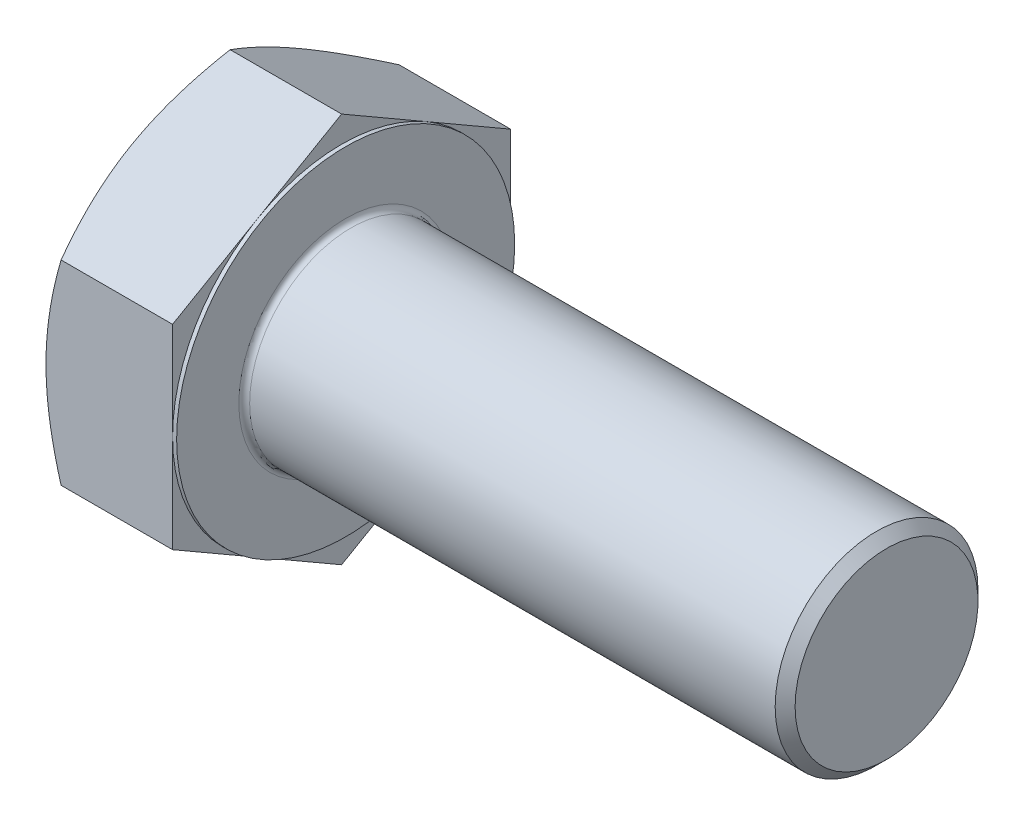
ISO-10303-21;
HEADER;
FILE_DESCRIPTION(('STEP AP214'),'2;1');
FILE_NAME('part.step','',(''),(''),'','','');
FILE_SCHEMA(('AUTOMOTIVE_DESIGN { 1 0 10303 214 1 1 1 1 }'));
ENDSEC;
DATA;
#1=APPLICATION_CONTEXT('core data for automotive mechanical design processes');
#2=APPLICATION_PROTOCOL_DEFINITION('international standard','automotive_design',2000,#1);
#3=PRODUCT_CONTEXT('',#1,'mechanical');
#4=PRODUCT('Part','Part','',(#3));
#5=PRODUCT_RELATED_PRODUCT_CATEGORY('part','',(#4));
#6=PRODUCT_DEFINITION_FORMATION('','',#4);
#7=PRODUCT_DEFINITION_CONTEXT('part definition',#1,'design');
#8=PRODUCT_DEFINITION('design','',#6,#7);
#9=PRODUCT_DEFINITION_SHAPE('','',#8);
#10=(LENGTH_UNIT() NAMED_UNIT(*) SI_UNIT(.MILLI.,.METRE.));
#11=(NAMED_UNIT(*) PLANE_ANGLE_UNIT() SI_UNIT($,.RADIAN.));
#12=(NAMED_UNIT(*) SI_UNIT($,.STERADIAN.) SOLID_ANGLE_UNIT());
#13=UNCERTAINTY_MEASURE_WITH_UNIT(LENGTH_MEASURE(1.E-05),#10,'distance_accuracy_value','');
#14=(GEOMETRIC_REPRESENTATION_CONTEXT(3) GLOBAL_UNCERTAINTY_ASSIGNED_CONTEXT((#13)) GLOBAL_UNIT_ASSIGNED_CONTEXT((#10,
#11,#12)) REPRESENTATION_CONTEXT('',''));
#15=CARTESIAN_POINT('',(0.,0.,0.));
#16=DIRECTION('',(0.,0.,1.));
#17=DIRECTION('',(1.,0.,0.));
#18=AXIS2_PLACEMENT_3D('',#15,#16,#17);
#19=CARTESIAN_POINT('',(12.2682,18.3308710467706,0.));
#20=DIRECTION('',(1.,0.,0.));
#21=DIRECTION('',(0.,0.,-1.));
#22=AXIS2_PLACEMENT_3D('',#19,#20,#21);
#23=PLANE('',#22);
#24=CARTESIAN_POINT('',(12.2682,0.,0.));
#25=DIRECTION('',(1.,0.,0.));
#26=DIRECTION('',(0.,0.,-1.));
#27=AXIS2_PLACEMENT_3D('',#24,#25,#26);
#28=CIRCLE('',#27,10.033);
#29=CARTESIAN_POINT('',(12.2682,0.,-10.033));
#30=VERTEX_POINT('',#29);
#31=EDGE_CURVE('E40',#30,#30,#28,.F.);
#32=ORIENTED_EDGE('',*,*,#31,.T.);
#33=EDGE_LOOP('',(#32));
#34=FACE_BOUND('',#33,.T.);
#35=CARTESIAN_POINT('',(12.2682,0.,0.));
#36=DIRECTION('',(1.,0.,0.));
#37=DIRECTION('',(0.,0.,-1.));
#38=AXIS2_PLACEMENT_3D('',#35,#36,#37);
#39=CIRCLE('',#38,15.875);
#40=CARTESIAN_POINT('',(12.2682,0.,-15.875));
#41=VERTEX_POINT('',#40);
#42=EDGE_CURVE('E291',#41,#41,#39,.T.);
#43=ORIENTED_EDGE('',*,*,#42,.T.);
#44=EDGE_LOOP('',(#43));
#45=FACE_BOUND('',#44,.T.);
#46=ADVANCED_FACE('F32',(#34,#45),#23,.T.);
#47=CARTESIAN_POINT('',(0.,0.,0.));
#48=DIRECTION('',(-1.,0.,0.));
#49=DIRECTION('',(0.,0.,1.));
#50=AXIS2_PLACEMENT_3D('',#47,#48,#49);
#51=CYLINDRICAL_SURFACE('',#50,9.525);
#52=CARTESIAN_POINT('',(12.7762,0.,0.));
#53=DIRECTION('',(1.,0.,0.));
#54=DIRECTION('',(0.,0.,-1.));
#55=AXIS2_PLACEMENT_3D('',#52,#53,#54);
#56=CIRCLE('',#55,9.525);
#57=CARTESIAN_POINT('',(12.7762,0.,-9.525));
#58=VERTEX_POINT('',#57);
#59=EDGE_CURVE('E11',#58,#58,#56,.T.);
#60=ORIENTED_EDGE('',*,*,#59,.T.);
#61=EDGE_LOOP('',(#60));
#62=FACE_BOUND('',#61,.T.);
#63=CARTESIAN_POINT('',(62.13221,0.,0.));
#64=DIRECTION('',(-1.,0.,0.));
#65=DIRECTION('',(0.,0.,1.));
#66=AXIS2_PLACEMENT_3D('',#63,#64,#65);
#67=CIRCLE('',#66,9.525);
#68=CARTESIAN_POINT('',(62.13221,0.,9.525));
#69=VERTEX_POINT('',#68);
#70=EDGE_CURVE('E270',#69,#69,#67,.T.);
#71=ORIENTED_EDGE('',*,*,#70,.T.);
#72=EDGE_LOOP('',(#71));
#73=FACE_BOUND('',#72,.T.);
#74=ADVANCED_FACE('F244',(#62,#73),#51,.T.);
#75=CARTESIAN_POINT('',(63.0682,0.,0.));
#76=DIRECTION('',(-1.,0.,0.));
#77=DIRECTION('',(0.,0.,1.));
#78=AXIS2_PLACEMENT_3D('',#75,#76,#77);
#79=CONICAL_SURFACE('',#78,8.58901,0.785398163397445);
#80=ORIENTED_EDGE('',*,*,#70,.F.);
#81=EDGE_LOOP('',(#80));
#82=FACE_BOUND('',#81,.T.);
#83=CARTESIAN_POINT('',(63.0682,0.,0.));
#84=DIRECTION('',(-1.,0.,0.));
#85=DIRECTION('',(0.,0.,1.));
#86=AXIS2_PLACEMENT_3D('',#83,#84,#85);
#87=CIRCLE('',#86,8.58901);
#88=CARTESIAN_POINT('',(63.0682,0.,8.58901));
#89=VERTEX_POINT('',#88);
#90=EDGE_CURVE('E268',#89,#89,#87,.T.);
#91=ORIENTED_EDGE('',*,*,#90,.T.);
#92=EDGE_LOOP('',(#91));
#93=FACE_BOUND('',#92,.T.);
#94=ADVANCED_FACE('F249',(#82,#93),#79,.T.);
#95=CARTESIAN_POINT('',(63.0682,0.,0.));
#96=DIRECTION('',(-1.,0.,0.));
#97=DIRECTION('',(0.,0.,1.));
#98=AXIS2_PLACEMENT_3D('',#95,#96,#97);
#99=PLANE('',#98);
#100=ORIENTED_EDGE('',*,*,#90,.F.);
#101=EDGE_LOOP('',(#100));
#102=FACE_BOUND('',#101,.T.);
#103=ADVANCED_FACE('F256',(#102),#99,.F.);
#104=CARTESIAN_POINT('',(11.8872,15.875,0.));
#105=DIRECTION('',(1.,0.,0.));
#106=DIRECTION('',(0.,0.,-1.));
#107=AXIS2_PLACEMENT_3D('',#104,#105,#106);
#108=PLANE('',#107);
#109=DIRECTION('',(0.,0.500000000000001,0.866025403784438));
#110=VECTOR('',#109,1.);
#111=CARTESIAN_POINT('',(11.8872,9.1654355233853,-15.875));
#112=LINE('',#111,#110);
#113=CARTESIAN_POINT('',(11.8872,9.1654355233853,-15.875));
#114=VERTEX_POINT('',#113);
#115=CARTESIAN_POINT('',(11.8872,13.748153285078,-7.93750000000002));
#116=VERTEX_POINT('',#115);
#117=EDGE_CURVE('E164',#114,#116,#112,.T.);
#118=ORIENTED_EDGE('',*,*,#117,.T.);
#119=CARTESIAN_POINT('',(11.8872,0.,0.));
#120=DIRECTION('',(-1.,0.,0.));
#121=DIRECTION('',(0.,0.,1.));
#122=AXIS2_PLACEMENT_3D('',#119,#120,#121);
#123=CIRCLE('',#122,15.875);
#124=CARTESIAN_POINT('',(11.8872,0.,-15.875));
#125=VERTEX_POINT('',#124);
#126=EDGE_CURVE('E47',#116,#125,#123,.T.);
#127=ORIENTED_EDGE('',*,*,#126,.T.);
#128=DIRECTION('',(0.,1.,0.));
#129=VECTOR('',#128,1.);
#130=CARTESIAN_POINT('',(11.8872,9.1654355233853,-15.875));
#131=LINE('',#130,#129);
#132=EDGE_CURVE('E294',#125,#114,#131,.T.);
#133=ORIENTED_EDGE('',*,*,#132,.T.);
#134=EDGE_LOOP('',(#118,#127,#133));
#135=FACE_BOUND('',#134,.T.);
#136=ADVANCED_FACE('F259',(#135),#108,.T.);
#137=CARTESIAN_POINT('',(11.8872,18.3308710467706,0.));
#138=VERTEX_POINT('',#137);
#139=EDGE_CURVE('E162',#116,#138,#112,.T.);
#140=ORIENTED_EDGE('',*,*,#139,.T.);
#141=DIRECTION('',(0.,-0.500000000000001,0.866025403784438));
#142=VECTOR('',#141,1.);
#143=CARTESIAN_POINT('',(11.8872,18.3308710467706,0.));
#144=LINE('',#143,#142);
#145=CARTESIAN_POINT('',(11.8872,13.748153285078,7.93750000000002));
#146=VERTEX_POINT('',#145);
#147=EDGE_CURVE('E161',#138,#146,#144,.T.);
#148=ORIENTED_EDGE('',*,*,#147,.T.);
#149=EDGE_CURVE('E150',#146,#116,#123,.T.);
#150=ORIENTED_EDGE('',*,*,#149,.T.);
#151=EDGE_LOOP('',(#140,#148,#150));
#152=FACE_BOUND('',#151,.T.);
#153=ADVANCED_FACE('F264',(#152),#108,.T.);
#154=CARTESIAN_POINT('',(11.8872,9.1654355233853,15.875));
#155=VERTEX_POINT('',#154);
#156=EDGE_CURVE('E129',#146,#155,#144,.T.);
#157=ORIENTED_EDGE('',*,*,#156,.T.);
#158=DIRECTION('',(0.,-1.,0.));
#159=VECTOR('',#158,1.);
#160=CARTESIAN_POINT('',(11.8872,9.1654355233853,15.875));
#161=LINE('',#160,#159);
#162=CARTESIAN_POINT('',(11.8872,0.,15.875));
#163=VERTEX_POINT('',#162);
#164=EDGE_CURVE('E123',#155,#163,#161,.T.);
#165=ORIENTED_EDGE('',*,*,#164,.T.);
#166=EDGE_CURVE('E127',#163,#146,#123,.T.);
#167=ORIENTED_EDGE('',*,*,#166,.T.);
#168=EDGE_LOOP('',(#157,#165,#167));
#169=FACE_BOUND('',#168,.T.);
#170=ADVANCED_FACE('F125',(#169),#108,.T.);
#171=CARTESIAN_POINT('',(11.8872,-9.16543552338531,15.875));
#172=VERTEX_POINT('',#171);
#173=EDGE_CURVE('E133',#163,#172,#161,.T.);
#174=ORIENTED_EDGE('',*,*,#173,.T.);
#175=DIRECTION('',(0.,-0.500000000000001,-0.866025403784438));
#176=VECTOR('',#175,1.);
#177=CARTESIAN_POINT('',(11.8872,-18.3308710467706,0.));
#178=LINE('',#177,#176);
#179=CARTESIAN_POINT('',(11.8872,-13.748153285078,7.93750000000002));
#180=VERTEX_POINT('',#179);
#181=EDGE_CURVE('E140',#172,#180,#178,.T.);
#182=ORIENTED_EDGE('',*,*,#181,.T.);
#183=EDGE_CURVE('E137',#180,#163,#123,.T.);
#184=ORIENTED_EDGE('',*,*,#183,.T.);
#185=EDGE_LOOP('',(#174,#182,#184));
#186=FACE_BOUND('',#185,.T.);
#187=ADVANCED_FACE('F138',(#186),#108,.T.);
#188=CARTESIAN_POINT('',(11.8872,-18.3308710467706,0.));
#189=VERTEX_POINT('',#188);
#190=EDGE_CURVE('E156',#180,#189,#178,.T.);
#191=ORIENTED_EDGE('',*,*,#190,.T.);
#192=DIRECTION('',(0.,0.5,-0.866025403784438));
#193=VECTOR('',#192,1.);
#194=CARTESIAN_POINT('',(11.8872,-9.16543552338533,-15.875));
#195=LINE('',#194,#193);
#196=CARTESIAN_POINT('',(11.8872,-13.748153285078,-7.93750000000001));
#197=VERTEX_POINT('',#196);
#198=EDGE_CURVE('E332',#189,#197,#195,.T.);
#199=ORIENTED_EDGE('',*,*,#198,.T.);
#200=EDGE_CURVE('E144',#197,#180,#123,.T.);
#201=ORIENTED_EDGE('',*,*,#200,.T.);
#202=EDGE_LOOP('',(#191,#199,#201));
#203=FACE_BOUND('',#202,.T.);
#204=ADVANCED_FACE('F333',(#203),#108,.T.);
#205=CARTESIAN_POINT('',(11.8872,-9.16543552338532,-15.875));
#206=VERTEX_POINT('',#205);
#207=EDGE_CURVE('E151',#197,#206,#195,.T.);
#208=ORIENTED_EDGE('',*,*,#207,.T.);
#209=EDGE_CURVE('E295',#206,#125,#131,.T.);
#210=ORIENTED_EDGE('',*,*,#209,.T.);
#211=EDGE_CURVE('E302',#125,#197,#123,.T.);
#212=ORIENTED_EDGE('',*,*,#211,.T.);
#213=EDGE_LOOP('',(#208,#210,#212));
#214=FACE_BOUND('',#213,.T.);
#215=ADVANCED_FACE('F265',(#214),#108,.T.);
#216=CARTESIAN_POINT('',(0.,0.,0.));
#217=DIRECTION('',(-1.,0.,0.));
#218=DIRECTION('',(0.,0.,1.));
#219=AXIS2_PLACEMENT_3D('',#216,#217,#218);
#220=CYLINDRICAL_SURFACE('',#219,15.875);
#221=ORIENTED_EDGE('',*,*,#126,.F.);
#222=ORIENTED_EDGE('',*,*,#149,.F.);
#223=ORIENTED_EDGE('',*,*,#166,.F.);
#224=ORIENTED_EDGE('',*,*,#183,.F.);
#225=ORIENTED_EDGE('',*,*,#200,.F.);
#226=ORIENTED_EDGE('',*,*,#211,.F.);
#227=EDGE_LOOP('',(#221,#222,#223,#224,#225,#226));
#228=FACE_BOUND('',#227,.T.);
#229=ORIENTED_EDGE('',*,*,#42,.F.);
#230=EDGE_LOOP('',(#229));
#231=FACE_BOUND('',#230,.T.);
#232=ADVANCED_FACE('F147',(#228,#231),#220,.T.);
#233=CARTESIAN_POINT('',(0.,18.3308710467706,0.));
#234=DIRECTION('',(1.,0.,0.));
#235=DIRECTION('',(0.,0.,-1.));
#236=AXIS2_PLACEMENT_3D('',#233,#234,#235);
#237=PLANE('',#236);
#238=CARTESIAN_POINT('',(0.,0.,0.));
#239=DIRECTION('',(1.,0.,0.));
#240=DIRECTION('',(0.,0.,-1.));
#241=AXIS2_PLACEMENT_3D('',#238,#239,#240);
#242=CIRCLE('',#241,15.875);
#243=CARTESIAN_POINT('',(0.,0.,-15.875));
#244=VERTEX_POINT('',#243);
#245=CARTESIAN_POINT('',(0.,13.748153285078,-7.93750000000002));
#246=VERTEX_POINT('',#245);
#247=EDGE_CURVE('E290',#244,#246,#242,.T.);
#248=ORIENTED_EDGE('',*,*,#247,.F.);
#249=CARTESIAN_POINT('',(0.,-13.748153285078,-7.93750000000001));
#250=VERTEX_POINT('',#249);
#251=EDGE_CURVE('E286',#250,#244,#242,.T.);
#252=ORIENTED_EDGE('',*,*,#251,.F.);
#253=CARTESIAN_POINT('',(0.,-13.748153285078,7.93750000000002));
#254=VERTEX_POINT('',#253);
#255=EDGE_CURVE('E289',#254,#250,#242,.T.);
#256=ORIENTED_EDGE('',*,*,#255,.F.);
#257=CARTESIAN_POINT('',(0.,0.,15.875));
#258=VERTEX_POINT('',#257);
#259=EDGE_CURVE('E325',#258,#254,#242,.T.);
#260=ORIENTED_EDGE('',*,*,#259,.F.);
#261=CARTESIAN_POINT('',(0.,0.,0.));
#262=DIRECTION('',(-1.,0.,0.));
#263=DIRECTION('',(0.,0.,1.));
#264=AXIS2_PLACEMENT_3D('',#261,#262,#263);
#265=CIRCLE('',#264,15.875);
#266=CARTESIAN_POINT('',(0.,13.748153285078,7.93750000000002));
#267=VERTEX_POINT('',#266);
#268=EDGE_CURVE('E165',#258,#267,#265,.T.);
#269=ORIENTED_EDGE('',*,*,#268,.T.);
#270=EDGE_CURVE('E348',#246,#267,#242,.T.);
#271=ORIENTED_EDGE('',*,*,#270,.F.);
#272=EDGE_LOOP('',(#248,#252,#256,#260,#269,#271));
#273=FACE_BOUND('',#272,.T.);
#274=ADVANCED_FACE('F194',(#273),#237,.F.);
#275=CARTESIAN_POINT('',(0.,0.,0.));
#276=DIRECTION('',(1.,0.,0.));
#277=DIRECTION('',(0.,0.,-1.));
#278=AXIS2_PLACEMENT_3D('',#275,#276,#277);
#279=CONICAL_SURFACE('',#278,15.875,1.0471975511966);
#280=CARTESIAN_POINT('',(1.41796447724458,9.16532005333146,15.8752));
#281=CARTESIAN_POINT('',(1.30166349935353,9.36677266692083,15.5262738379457));
#282=CARTESIAN_POINT('',(1.19064005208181,9.56901105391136,15.1759866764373));
#283=CARTESIAN_POINT('',(0.980615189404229,9.97510954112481,14.4726034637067));
#284=CARTESIAN_POINT('',(0.881617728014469,10.1789701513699,14.1195065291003));
#285=CARTESIAN_POINT('',(0.69697556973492,10.5887070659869,13.4098213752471));
#286=CARTESIAN_POINT('',(0.61136246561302,10.7945869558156,13.0532269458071));
#287=CARTESIAN_POINT('',(0.455327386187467,11.2077773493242,12.3375601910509));
#288=CARTESIAN_POINT('',(0.384904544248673,11.4150877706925,11.9784880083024));
#289=CARTESIAN_POINT('',(0.262245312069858,11.8258271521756,11.2670665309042));
#290=CARTESIAN_POINT('',(0.209602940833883,12.0292256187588,10.9147700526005));
#291=CARTESIAN_POINT('',(0.121333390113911,12.4369545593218,10.2085628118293));
#292=CARTESIAN_POINT('',(0.0857065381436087,12.6412850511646,9.85465201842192));
#293=CARTESIAN_POINT('',(0.0323675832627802,13.0502892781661,9.146235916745));
#294=CARTESIAN_POINT('',(0.0146341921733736,13.2549623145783,8.79173181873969));
#295=CARTESIAN_POINT('',(-0.00253647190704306,13.6644973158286,8.08239638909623));
#296=CARTESIAN_POINT('',(-0.0019743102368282,13.8693592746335,7.72756506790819));
#297=CARTESIAN_POINT('',(0.01616810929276,14.2523467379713,7.06421132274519));
#298=CARTESIAN_POINT('',(0.0315354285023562,14.4304995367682,6.75564162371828));
#299=CARTESIAN_POINT('',(0.0758164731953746,14.7863953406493,6.13921200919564));
#300=CARTESIAN_POINT('',(0.104731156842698,14.9641383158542,5.83135214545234));
#301=CARTESIAN_POINT('',(0.175602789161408,15.3191179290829,5.21650941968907));
#302=CARTESIAN_POINT('',(0.217570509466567,15.4963540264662,4.90952749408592));
#303=CARTESIAN_POINT('',(0.313811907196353,15.8499953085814,4.2970028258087));
#304=CARTESIAN_POINT('',(0.368086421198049,16.026400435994,3.99146018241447));
#305=CARTESIAN_POINT('',(0.55074213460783,16.5618879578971,3.06396858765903));
#306=CARTESIAN_POINT('',(0.69733592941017,16.919419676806,2.44470548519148));
#307=CARTESIAN_POINT('',(1.03004377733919,17.6291519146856,1.21541318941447));
#308=CARTESIAN_POINT('',(1.21607969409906,17.981361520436,0.605368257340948));
#309=CARTESIAN_POINT('',(1.4179644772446,18.3309865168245,-0.000199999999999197));
#310=B_SPLINE_CURVE_WITH_KNOTS('',3,(#280,#281,#282,#283,#284,#285,#286,#287,#288,#289,#290,
#291,#292,#293,#294,#295,#296,#297,#298,#299,#300,#301,#302,#303,#304,#305,#306,#307,#308,#309),
.UNSPECIFIED.,.F.,.F.,(4,2,2,2,2,2,2,2,2,2,2,2,2,2,4),(0.,1.25809764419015,2.51660782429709,
3.77804517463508,5.03941053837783,6.26964248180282,7.49989810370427,8.72868833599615,
9.95744059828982,11.0270932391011,12.0968215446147,13.1674349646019,14.238121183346,
16.4265775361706,18.6107383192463),.UNSPECIFIED.);
#311=CARTESIAN_POINT('',(1.41789780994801,18.3308710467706,0.));
#312=VERTEX_POINT('',#311);
#313=EDGE_CURVE('E213',#267,#312,#310,.T.);
#314=ORIENTED_EDGE('',*,*,#313,.T.);
#315=CARTESIAN_POINT('',(1.4179644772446,18.3309865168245,0.0002));
#316=CARTESIAN_POINT('',(1.30166349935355,18.1295339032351,-0.348726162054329));
#317=CARTESIAN_POINT('',(1.19064005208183,17.9272955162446,-0.699013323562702));
#318=CARTESIAN_POINT('',(0.980615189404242,17.5211970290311,-1.40239653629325));
#319=CARTESIAN_POINT('',(0.88161772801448,17.317336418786,-1.75549347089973));
#320=CARTESIAN_POINT('',(0.69697556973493,16.9075995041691,-2.46517862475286));
#321=CARTESIAN_POINT('',(0.61136246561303,16.7017196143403,-2.8217730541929));
#322=CARTESIAN_POINT('',(0.455327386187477,16.2885292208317,-3.53743980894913));
#323=CARTESIAN_POINT('',(0.384904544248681,16.0812187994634,-3.89651199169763));
#324=CARTESIAN_POINT('',(0.262245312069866,15.6704794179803,-4.60793346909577));
#325=CARTESIAN_POINT('',(0.209602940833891,15.4670809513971,-4.96022994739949));
#326=CARTESIAN_POINT('',(0.121333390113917,15.0593520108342,-5.6664371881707));
#327=CARTESIAN_POINT('',(0.085706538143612,14.8550215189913,-6.02034798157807));
#328=CARTESIAN_POINT('',(0.0323675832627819,14.4460172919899,-6.728764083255));
#329=CARTESIAN_POINT('',(0.0146341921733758,14.2413442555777,-7.08326818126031));
#330=CARTESIAN_POINT('',(-0.00253647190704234,13.8318092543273,-7.79260361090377));
#331=CARTESIAN_POINT('',(-0.00197431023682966,13.6269472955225,-8.14743493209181));
#332=CARTESIAN_POINT('',(0.016168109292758,13.2439598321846,-8.81078867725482));
#333=CARTESIAN_POINT('',(0.0315354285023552,13.0658070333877,-9.11935837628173));
#334=CARTESIAN_POINT('',(0.0758164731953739,12.7099112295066,-9.73578799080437));
#335=CARTESIAN_POINT('',(0.104731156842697,12.5321682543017,-10.0436478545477));
#336=CARTESIAN_POINT('',(0.175602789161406,12.177188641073,-10.6584905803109));
#337=CARTESIAN_POINT('',(0.217570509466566,11.9999525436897,-10.9654725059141));
#338=CARTESIAN_POINT('',(0.31381190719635,11.6463112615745,-11.5779971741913));
#339=CARTESIAN_POINT('',(0.368086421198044,11.469906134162,-11.8835398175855));
#340=CARTESIAN_POINT('',(0.550742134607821,10.9344186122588,-12.811031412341));
#341=CARTESIAN_POINT('',(0.697335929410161,10.57688689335,-13.4302945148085));
#342=CARTESIAN_POINT('',(1.03004377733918,9.86715465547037,-14.6595868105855));
#343=CARTESIAN_POINT('',(1.21607969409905,9.51494504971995,-15.2696317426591));
#344=CARTESIAN_POINT('',(1.41796447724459,9.16532005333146,-15.8752));
#345=B_SPLINE_CURVE_WITH_KNOTS('',3,(#315,#316,#317,#318,#319,#320,#321,#322,#323,#324,#325,
#326,#327,#328,#329,#330,#331,#332,#333,#334,#335,#336,#337,#338,#339,#340,#341,#342,#343,#344),
.UNSPECIFIED.,.F.,.F.,(4,2,2,2,2,2,2,2,2,2,2,2,2,2,4),(0.,1.25809764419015,2.51660782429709,
3.77804517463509,5.03941053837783,6.26964248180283,7.49989810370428,8.72868833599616,
9.95744059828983,11.0270932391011,12.0968215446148,13.1674349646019,14.238121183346,
16.4265775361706,18.6107383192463),.UNSPECIFIED.);
#346=EDGE_CURVE('E55',#312,#246,#345,.T.);
#347=ORIENTED_EDGE('',*,*,#346,.T.);
#348=ORIENTED_EDGE('',*,*,#270,.T.);
#349=EDGE_LOOP('',(#314,#347,#348));
#350=FACE_BOUND('',#349,.T.);
#351=ADVANCED_FACE('F349',(#350),#279,.T.);
#352=CARTESIAN_POINT('',(7.84497386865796,-24.8202831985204,15.875));
#353=CARTESIAN_POINT('',(7.67595391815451,-24.4727664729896,15.875));
#354=CARTESIAN_POINT('',(7.50776171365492,-24.1248473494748,15.875));
#355=CARTESIAN_POINT('',(7.17321987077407,-23.4281204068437,15.875));
#356=CARTESIAN_POINT('',(7.00687025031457,-23.0793125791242,15.875));
#357=CARTESIAN_POINT('',(6.51082332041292,-22.0313400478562,15.875));
#358=CARTESIAN_POINT('',(6.18417657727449,-21.3307260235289,15.875));
#359=CARTESIAN_POINT('',(5.53923927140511,-19.9211586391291,15.875));
#360=CARTESIAN_POINT('',(5.22100216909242,-19.2121807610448,15.875));
#361=CARTESIAN_POINT('',(4.5972800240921,-17.788656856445,15.875));
#362=CARTESIAN_POINT('',(4.29179439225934,-17.074111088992,15.875));
#363=CARTESIAN_POINT('',(3.68705721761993,-15.6144543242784,15.875));
#364=CARTESIAN_POINT('',(3.38835008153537,-14.8691166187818,15.875));
#365=CARTESIAN_POINT('',(2.81305944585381,-13.3697904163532,15.875));
#366=CARTESIAN_POINT('',(2.53647840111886,-12.6158009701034,15.875));
#367=CARTESIAN_POINT('',(2.01255860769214,-11.0993435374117,15.875));
#368=CARTESIAN_POINT('',(1.76516234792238,-10.3368955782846,15.875));
#369=CARTESIAN_POINT('',(1.3074029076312,-8.80099241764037,15.875));
#370=CARTESIAN_POINT('',(1.09702827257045,-8.02754070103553,15.875));
#371=CARTESIAN_POINT('',(0.817325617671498,-6.86111841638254,15.875));
#372=CARTESIAN_POINT('',(0.730263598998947,-6.47237592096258,15.875));
#373=CARTESIAN_POINT('',(0.569108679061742,-5.69219801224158,15.875));
#374=CARTESIAN_POINT('',(0.495015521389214,-5.30076265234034,15.875));
#375=CARTESIAN_POINT('',(0.361093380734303,-4.51545346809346,15.875));
#376=CARTESIAN_POINT('',(0.301264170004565,-4.12157968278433,15.875));
#377=CARTESIAN_POINT('',(0.197055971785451,-3.33179689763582,15.875));
#378=CARTESIAN_POINT('',(0.152676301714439,-2.93588798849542,15.875));
#379=CARTESIAN_POINT('',(0.0808161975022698,-2.14784188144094,15.875));
#380=CARTESIAN_POINT('',(0.0531187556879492,-1.75572459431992,15.875));
#381=CARTESIAN_POINT('',(0.0143409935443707,-0.970670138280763,15.875));
#382=CARTESIAN_POINT('',(0.00326039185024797,-0.577732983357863,15.875));
#383=CARTESIAN_POINT('',(-0.00201925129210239,0.208258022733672,15.875));
#384=CARTESIAN_POINT('',(0.00378172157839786,0.601311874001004,15.875));
#385=CARTESIAN_POINT('',(0.0321213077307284,1.3868203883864,15.875));
#386=CARTESIAN_POINT('',(0.0546606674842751,1.7792750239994,15.875));
#387=CARTESIAN_POINT('',(0.12798677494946,2.71645285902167,15.875));
#388=CARTESIAN_POINT('',(0.18638079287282,3.26059174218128,15.875));
#389=CARTESIAN_POINT('',(0.332213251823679,4.34496561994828,15.875));
#390=CARTESIAN_POINT('',(0.4196554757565,4.885200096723,15.875));
#391=CARTESIAN_POINT('',(0.620474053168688,5.96120438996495,15.875));
#392=CARTESIAN_POINT('',(0.733870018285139,6.49697051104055,15.875));
#393=CARTESIAN_POINT('',(0.983124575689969,7.56319485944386,15.875));
#394=CARTESIAN_POINT('',(1.11898287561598,8.09365315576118,15.875));
#395=CARTESIAN_POINT('',(1.4130905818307,9.1610554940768,15.875));
#396=CARTESIAN_POINT('',(1.57177257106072,9.69787951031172,15.875));
#397=CARTESIAN_POINT('',(1.90593868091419,10.7662424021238,15.875));
#398=CARTESIAN_POINT('',(2.08142291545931,11.2977812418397,15.875));
#399=CARTESIAN_POINT('',(2.44637178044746,12.3558294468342,15.875));
#400=CARTESIAN_POINT('',(2.63583204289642,12.8823403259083,15.875));
#401=CARTESIAN_POINT('',(3.02646423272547,13.9309723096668,15.875));
#402=CARTESIAN_POINT('',(3.22763600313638,14.4530934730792,15.875));
#403=CARTESIAN_POINT('',(3.72655173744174,15.7125455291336,15.875));
#404=CARTESIAN_POINT('',(4.02928355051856,16.4478978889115,15.875));
#405=CARTESIAN_POINT('',(4.65015899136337,17.9120878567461,15.875));
#406=CARTESIAN_POINT('',(4.96830369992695,18.6409250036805,15.875));
#407=CARTESIAN_POINT('',(5.61682913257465,20.0933407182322,15.875));
#408=CARTESIAN_POINT('',(5.94721293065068,20.8169179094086,15.875));
#409=CARTESIAN_POINT('',(6.61767222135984,22.2595345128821,15.875));
#410=CARTESIAN_POINT('',(6.95774747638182,22.9785740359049,15.875));
#411=CARTESIAN_POINT('',(7.64613929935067,24.4137493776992,15.875));
#412=CARTESIAN_POINT('',(7.99446524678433,25.1298806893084,15.875));
#413=CARTESIAN_POINT('',(8.69752300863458,26.5589916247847,15.875));
#414=CARTESIAN_POINT('',(9.05225485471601,27.2719712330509,15.875));
#415=CARTESIAN_POINT('',(9.76694765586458,28.6951744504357,15.875));
#416=CARTESIAN_POINT('',(10.126907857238,29.4053984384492,15.875));
#417=CARTESIAN_POINT('',(10.8512282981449,30.823594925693,15.875));
#418=CARTESIAN_POINT('',(11.2155885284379,31.5315674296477,15.875));
#419=CARTESIAN_POINT('',(12.2500056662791,33.5287000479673,15.875));
#420=CARTESIAN_POINT('',(12.9243514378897,34.8156386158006,15.875));
#421=CARTESIAN_POINT('',(14.2821577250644,37.3847525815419,15.875));
#422=CARTESIAN_POINT('',(14.9656186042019,38.6669277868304,15.875));
#423=CARTESIAN_POINT('',(16.3376382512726,41.2241071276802,15.875));
#424=CARTESIAN_POINT('',(17.0261783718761,42.4991212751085,15.875));
#425=CARTESIAN_POINT('',(18.0630078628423,44.4094093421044,15.875));
#426=CARTESIAN_POINT('',(18.4092773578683,45.0457811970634,15.875));
#427=CARTESIAN_POINT('',(19.1030208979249,46.3178667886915,15.875));
#428=CARTESIAN_POINT('',(19.4504949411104,46.9535805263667,15.875));
#429=CARTESIAN_POINT('',(19.7985008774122,47.589003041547,15.875));
#430=B_SPLINE_CURVE_WITH_KNOTS('',3,(#352,#353,#354,#355,#356,#357,#358,#359,#360,#361,#362,
#363,#364,#365,#366,#367,#368,#369,#370,#371,#372,#373,#374,#375,#376,#377,#378,#379,#380,#381,
#382,#383,#384,#385,#386,#387,#388,#389,#390,#391,#392,#393,#394,#395,#396,#397,#398,#399,#400,
#401,#402,#403,#404,#405,#406,#407,#408,#409,#410,#411,#412,#413,#414,#415,#416,#417,#418,#419,
#420,#421,#422,#423,#424,#425,#426,#427,#428,#429),.UNSPECIFIED.,.F.,.F.,(4,2,2,2,2,2,2,2,2,2,2,
2,2,2,2,2,2,2,2,2,2,2,2,2,2,2,2,2,2,2,2,2,2,2,2,2,2,2,4),(0.,1.15931697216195,2.31864521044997,
4.63763453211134,6.96891393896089,9.30008551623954,11.7087149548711,14.1176112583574,
16.5216783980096,18.9250004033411,20.1199361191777,21.3148482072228,22.5097412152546,
23.7045814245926,24.8835227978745,26.0624442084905,27.2413666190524,28.4203416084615,
30.0612276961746,31.7023275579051,33.3446716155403,34.9869942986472,36.6660234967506,
38.3450640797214,40.0235821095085,41.7020776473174,44.0875229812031,46.4731358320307,
48.8593519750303,51.2455096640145,53.6345241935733,56.0235505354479,58.4122358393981,
60.8009161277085,65.159596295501,69.5184508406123,73.8655858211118,76.0390257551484,
78.2124623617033),.UNSPECIFIED.);
#431=CARTESIAN_POINT('',(1.417897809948,9.1654355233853,15.875));
#432=VERTEX_POINT('',#431);
#433=EDGE_CURVE('E225',#258,#432,#430,.T.);
#434=ORIENTED_EDGE('',*,*,#433,.T.);
#435=EDGE_CURVE('E224',#432,#267,#310,.T.);
#436=ORIENTED_EDGE('',*,*,#435,.T.);
#437=ORIENTED_EDGE('',*,*,#268,.F.);
#438=EDGE_LOOP('',(#434,#436,#437));
#439=FACE_BOUND('',#438,.T.);
#440=ADVANCED_FACE('F319',(#439),#279,.T.);
#441=CARTESIAN_POINT('',(1.417897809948,-9.16543552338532,15.875));
#442=VERTEX_POINT('',#441);
#443=EDGE_CURVE('E271',#442,#258,#430,.T.);
#444=ORIENTED_EDGE('',*,*,#443,.T.);
#445=ORIENTED_EDGE('',*,*,#259,.T.);
#446=CARTESIAN_POINT('',(1.41796447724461,-18.3309865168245,-0.000199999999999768));
#447=CARTESIAN_POINT('',(1.30166349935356,-18.1295339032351,0.348726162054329));
#448=CARTESIAN_POINT('',(1.19064005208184,-17.9272955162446,0.6990133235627));
#449=CARTESIAN_POINT('',(0.980615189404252,-17.5211970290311,1.40239653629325));
#450=CARTESIAN_POINT('',(0.881617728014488,-17.3173364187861,1.75549347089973));
#451=CARTESIAN_POINT('',(0.696975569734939,-16.9075995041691,2.46517862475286));
#452=CARTESIAN_POINT('',(0.611362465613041,-16.7017196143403,2.8217730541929));
#453=CARTESIAN_POINT('',(0.455327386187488,-16.2885292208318,3.53743980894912));
#454=CARTESIAN_POINT('',(0.38490454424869,-16.0812187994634,3.89651199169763));
#455=CARTESIAN_POINT('',(0.262245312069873,-15.6704794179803,4.60793346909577));
#456=CARTESIAN_POINT('',(0.209602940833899,-15.4670809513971,4.96022994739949));
#457=CARTESIAN_POINT('',(0.121333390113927,-15.0593520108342,5.6664371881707));
#458=CARTESIAN_POINT('',(0.085706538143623,-14.8550215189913,6.02034798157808));
#459=CARTESIAN_POINT('',(0.0323675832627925,-14.4460172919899,6.72876408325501));
#460=CARTESIAN_POINT('',(0.0146341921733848,-14.2413442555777,7.08326818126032));
#461=CARTESIAN_POINT('',(-0.00253647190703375,-13.8318092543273,7.79260361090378));
#462=CARTESIAN_POINT('',(-0.00197431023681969,-13.6269472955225,8.14743493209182));
#463=CARTESIAN_POINT('',(0.016168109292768,-13.2439598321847,8.81078867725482));
#464=CARTESIAN_POINT('',(0.0315354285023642,-13.0658070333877,9.11935837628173));
#465=CARTESIAN_POINT('',(0.0758164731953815,-12.7099112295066,9.73578799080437));
#466=CARTESIAN_POINT('',(0.104731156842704,-12.5321682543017,10.0436478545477));
#467=CARTESIAN_POINT('',(0.175602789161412,-12.177188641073,10.6584905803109));
#468=CARTESIAN_POINT('',(0.217570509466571,-11.9999525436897,10.9654725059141));
#469=CARTESIAN_POINT('',(0.313811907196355,-11.6463112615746,11.5779971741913));
#470=CARTESIAN_POINT('',(0.36808642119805,-11.469906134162,11.8835398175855));
#471=CARTESIAN_POINT('',(0.550742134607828,-10.9344186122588,12.811031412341));
#472=CARTESIAN_POINT('',(0.697335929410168,-10.57688689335,13.4302945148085));
#473=CARTESIAN_POINT('',(1.03004377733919,-9.86715465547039,14.6595868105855));
#474=CARTESIAN_POINT('',(1.21607969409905,-9.51494504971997,15.269631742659));
#475=CARTESIAN_POINT('',(1.41796447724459,-9.16532005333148,15.8752));
#476=B_SPLINE_CURVE_WITH_KNOTS('',3,(#446,#447,#448,#449,#450,#451,#452,#453,#454,#455,#456,
#457,#458,#459,#460,#461,#462,#463,#464,#465,#466,#467,#468,#469,#470,#471,#472,#473,#474,#475),
.UNSPECIFIED.,.F.,.F.,(4,2,2,2,2,2,2,2,2,2,2,2,2,2,4),(0.,1.25809764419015,2.51660782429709,
3.77804517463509,5.03941053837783,6.26964248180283,7.49989810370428,8.72868833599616,
9.95744059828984,11.0270932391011,12.0968215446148,13.1674349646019,14.238121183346,
16.4265775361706,18.6107383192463),.UNSPECIFIED.);
#477=EDGE_CURVE('E215',#254,#442,#476,.T.);
#478=ORIENTED_EDGE('',*,*,#477,.T.);
#479=EDGE_LOOP('',(#444,#445,#478));
#480=FACE_BOUND('',#479,.T.);
#481=ADVANCED_FACE('F183',(#480),#279,.T.);
#482=CARTESIAN_POINT('',(1.41789780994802,-18.3308710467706,0.));
#483=VERTEX_POINT('',#482);
#484=EDGE_CURVE('E208',#483,#254,#476,.T.);
#485=ORIENTED_EDGE('',*,*,#484,.T.);
#486=ORIENTED_EDGE('',*,*,#255,.T.);
#487=CARTESIAN_POINT('',(1.41796447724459,-9.16532005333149,-15.8752));
#488=CARTESIAN_POINT('',(1.30166349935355,-9.36677266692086,-15.5262738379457));
#489=CARTESIAN_POINT('',(1.19064005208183,-9.56901105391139,-15.1759866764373));
#490=CARTESIAN_POINT('',(0.980615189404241,-9.97510954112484,-14.4726034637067));
#491=CARTESIAN_POINT('',(0.881617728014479,-10.1789701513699,-14.1195065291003));
#492=CARTESIAN_POINT('',(0.69697556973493,-10.5887070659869,-13.4098213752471));
#493=CARTESIAN_POINT('',(0.611362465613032,-10.7945869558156,-13.0532269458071));
#494=CARTESIAN_POINT('',(0.455327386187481,-11.2077773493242,-12.3375601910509));
#495=CARTESIAN_POINT('',(0.384904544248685,-11.4150877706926,-11.9784880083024));
#496=CARTESIAN_POINT('',(0.26224531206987,-11.8258271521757,-11.2670665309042));
#497=CARTESIAN_POINT('',(0.209602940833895,-12.0292256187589,-10.9147700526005));
#498=CARTESIAN_POINT('',(0.121333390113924,-12.4369545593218,-10.2085628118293));
#499=CARTESIAN_POINT('',(0.0857065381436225,-12.6412850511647,-9.85465201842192));
#500=CARTESIAN_POINT('',(0.0323675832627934,-13.0502892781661,-9.14623591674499));
#501=CARTESIAN_POINT('',(0.014634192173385,-13.2549623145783,-8.79173181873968));
#502=CARTESIAN_POINT('',(-0.00253647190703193,-13.6644973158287,-8.08239638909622));
#503=CARTESIAN_POINT('',(-0.00197431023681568,-13.8693592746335,-7.72756506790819));
#504=CARTESIAN_POINT('',(0.016168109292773,-14.2523467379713,-7.06421132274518));
#505=CARTESIAN_POINT('',(0.0315354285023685,-14.4304995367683,-6.75564162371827));
#506=CARTESIAN_POINT('',(0.0758164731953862,-14.7863953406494,-6.13921200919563));
#507=CARTESIAN_POINT('',(0.10473115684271,-14.9641383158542,-5.83135214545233));
#508=CARTESIAN_POINT('',(0.175602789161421,-15.3191179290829,-5.21650941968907));
#509=CARTESIAN_POINT('',(0.217570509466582,-15.4963540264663,-4.90952749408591));
#510=CARTESIAN_POINT('',(0.313811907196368,-15.8499953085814,-4.29700282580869));
#511=CARTESIAN_POINT('',(0.368086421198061,-16.026400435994,-3.99146018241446));
#512=CARTESIAN_POINT('',(0.550742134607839,-16.5618879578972,-3.06396858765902));
#513=CARTESIAN_POINT('',(0.697335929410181,-16.919419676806,-2.44470548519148));
#514=CARTESIAN_POINT('',(1.0300437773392,-17.6291519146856,-1.21541318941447));
#515=CARTESIAN_POINT('',(1.21607969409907,-17.981361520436,-0.605368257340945));
#516=CARTESIAN_POINT('',(1.4179644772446,-18.3309865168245,0.000199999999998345));
#517=B_SPLINE_CURVE_WITH_KNOTS('',3,(#487,#488,#489,#490,#491,#492,#493,#494,#495,#496,#497,
#498,#499,#500,#501,#502,#503,#504,#505,#506,#507,#508,#509,#510,#511,#512,#513,#514,#515,#516),
.UNSPECIFIED.,.F.,.F.,(4,2,2,2,2,2,2,2,2,2,2,2,2,2,4),(0.,1.25809764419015,2.51660782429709,
3.77804517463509,5.03941053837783,6.26964248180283,7.49989810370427,8.72868833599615,
9.95744059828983,11.0270932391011,12.0968215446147,13.1674349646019,14.238121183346,
16.4265775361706,18.6107383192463),.UNSPECIFIED.);
#518=EDGE_CURVE('E214',#250,#483,#517,.T.);
#519=ORIENTED_EDGE('',*,*,#518,.T.);
#520=EDGE_LOOP('',(#485,#486,#519));
#521=FACE_BOUND('',#520,.T.);
#522=ADVANCED_FACE('F347',(#521),#279,.T.);
#523=CARTESIAN_POINT('',(1.417897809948,9.1654355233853,-15.875));
#524=VERTEX_POINT('',#523);
#525=EDGE_CURVE('E216',#246,#524,#345,.T.);
#526=ORIENTED_EDGE('',*,*,#525,.T.);
#527=CARTESIAN_POINT('',(7.84497386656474,-24.8202831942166,-15.875));
#528=CARTESIAN_POINT('',(7.67595391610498,-24.4727664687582,-15.875));
#529=CARTESIAN_POINT('',(7.50776171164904,-24.1248473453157,-15.875));
#530=CARTESIAN_POINT('',(7.17321986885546,-23.4281204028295,-15.875));
#531=CARTESIAN_POINT('',(7.00687024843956,-23.0793125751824,-15.875));
#532=CARTESIAN_POINT('',(6.51082331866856,-22.031340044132,-15.875));
#533=CARTESIAN_POINT('',(6.18417657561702,-21.3307260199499,-15.875));
#534=CARTESIAN_POINT('',(5.53923926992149,-19.9211586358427,-15.875));
#535=CARTESIAN_POINT('',(5.22100216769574,-19.2121807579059,-15.875));
#536=CARTESIAN_POINT('',(4.59728002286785,-17.7886568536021,-15.875));
#537=CARTESIAN_POINT('',(4.29179439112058,-17.0741110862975,-15.875));
#538=CARTESIAN_POINT('',(3.68705721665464,-15.6144543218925,-15.875));
#539=CARTESIAN_POINT('',(3.38835008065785,-14.869116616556,-15.875));
#540=CARTESIAN_POINT('',(2.81305944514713,-13.3697904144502,-15.875));
#541=CARTESIAN_POINT('',(2.53647840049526,-12.6158009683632,-15.875));
#542=CARTESIAN_POINT('',(2.01255860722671,-11.0993435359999,-15.875));
#543=CARTESIAN_POINT('',(1.76516234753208,-10.3368955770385,-15.875));
#544=CARTESIAN_POINT('',(1.30740290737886,-8.80099241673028,-15.875));
#545=CARTESIAN_POINT('',(1.09702827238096,-8.02754070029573,-15.875));
#546=CARTESIAN_POINT('',(0.817325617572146,-6.86111841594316,-15.875));
#547=CARTESIAN_POINT('',(0.730263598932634,-6.47237592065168,-15.875));
#548=CARTESIAN_POINT('',(0.569108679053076,-5.69219801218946,-15.875));
#549=CARTESIAN_POINT('',(0.495015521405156,-5.30076265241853,-15.875));
#550=CARTESIAN_POINT('',(0.361093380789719,-4.5154534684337,-15.875));
#551=CARTESIAN_POINT('',(0.301264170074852,-4.1215796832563,-15.875));
#552=CARTESIAN_POINT('',(0.197055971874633,-3.33179689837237,-15.875));
#553=CARTESIAN_POINT('',(0.152676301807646,-2.93588798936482,-15.875));
#554=CARTESIAN_POINT('',(0.0808161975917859,-2.14784188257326,-15.875));
#555=CARTESIAN_POINT('',(0.0531187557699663,-1.7557245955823,-15.875));
#556=CARTESIAN_POINT('',(0.0143409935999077,-0.970670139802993,-15.875));
#557=CARTESIAN_POINT('',(0.00326039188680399,-0.577732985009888,-15.875));
#558=CARTESIAN_POINT('',(-0.00201925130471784,0.208258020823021,-15.875));
#559=CARTESIAN_POINT('',(0.00378172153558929,0.601311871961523,-15.875));
#560=CARTESIAN_POINT('',(0.0321213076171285,1.38682038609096,-15.875));
#561=CARTESIAN_POINT('',(0.0546606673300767,1.77927502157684,-15.875));
#562=CARTESIAN_POINT('',(0.127986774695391,2.71645285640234,-15.875));
#563=CARTESIAN_POINT('',(0.186380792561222,3.26059173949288,-15.875));
#564=CARTESIAN_POINT('',(0.332213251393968,4.34496561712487,-15.875));
#565=CARTESIAN_POINT('',(0.419655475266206,4.88520009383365,-15.875));
#566=CARTESIAN_POINT('',(0.62047405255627,5.96120438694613,-15.875));
#567=CARTESIAN_POINT('',(0.733870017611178,6.49697050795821,-15.875));
#568=CARTESIAN_POINT('',(0.983124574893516,7.56319485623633,-15.875));
#569=CARTESIAN_POINT('',(1.11898287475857,8.09365315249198,-15.875));
#570=CARTESIAN_POINT('',(1.41309058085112,9.16105549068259,-15.875));
#571=CARTESIAN_POINT('',(1.57177257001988,9.69787950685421,-15.875));
#572=CARTESIAN_POINT('',(1.90593867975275,10.7662423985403,-15.875));
#573=CARTESIAN_POINT('',(2.0814229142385,11.2977812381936,-15.875));
#574=CARTESIAN_POINT('',(2.44637177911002,12.3558294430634,-15.875));
#575=CARTESIAN_POINT('',(2.63583204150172,12.8823403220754,-15.875));
#576=CARTESIAN_POINT('',(3.02646423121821,13.9309723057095,-15.875));
#577=CARTESIAN_POINT('',(3.22763600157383,14.4530934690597,-15.875));
#578=CARTESIAN_POINT('',(3.72655173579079,15.7125455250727,-15.875));
#579=CARTESIAN_POINT('',(4.02928354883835,16.4478978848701,-15.875));
#580=CARTESIAN_POINT('',(4.65015898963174,17.9120878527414,-15.875));
#581=CARTESIAN_POINT('',(4.96830369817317,18.640924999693,-15.875));
#582=CARTESIAN_POINT('',(5.61682913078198,20.0933407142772,-15.875));
#583=CARTESIAN_POINT('',(5.94721292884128,20.8169179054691,-15.875));
#584=CARTESIAN_POINT('',(6.617672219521,22.2595345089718,-15.875));
#585=CARTESIAN_POINT('',(6.95774747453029,22.9785740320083,-15.875));
#586=CARTESIAN_POINT('',(7.64613929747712,24.4137493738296,-15.875));
#587=CARTESIAN_POINT('',(7.99446524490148,25.129880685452,-15.875));
#588=CARTESIAN_POINT('',(8.69752300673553,26.5589916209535,-15.875));
#589=CARTESIAN_POINT('',(9.05225485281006,27.2719712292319,-15.875));
#590=CARTESIAN_POINT('',(9.76694765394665,28.69517444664,-15.875));
#591=CARTESIAN_POINT('',(10.126907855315,29.4053984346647,-15.875));
#592=CARTESIAN_POINT('',(10.8512282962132,30.8235949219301,-15.875));
#593=CARTESIAN_POINT('',(11.2155885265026,31.5315674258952,-15.875));
#594=CARTESIAN_POINT('',(12.2500056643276,33.5287000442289,-15.875));
#595=CARTESIAN_POINT('',(12.9243514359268,34.8156386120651,-15.875));
#596=CARTESIAN_POINT('',(14.2821577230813,37.3847525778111,-15.875));
#597=CARTESIAN_POINT('',(14.9656186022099,38.6669277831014,-15.875));
#598=CARTESIAN_POINT('',(16.3376382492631,41.2241071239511,-15.875));
#599=CARTESIAN_POINT('',(17.026178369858,42.4991212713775,-15.875));
#600=CARTESIAN_POINT('',(18.0630078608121,44.4094093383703,-15.875));
#601=CARTESIAN_POINT('',(18.4092773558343,45.045781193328,-15.875));
#602=CARTESIAN_POINT('',(19.1030208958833,46.3178667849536,-15.875));
#603=CARTESIAN_POINT('',(19.4504949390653,46.9535805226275,-15.875));
#604=CARTESIAN_POINT('',(19.7985008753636,47.5890030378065,-15.875));
#605=B_SPLINE_CURVE_WITH_KNOTS('',3,(#527,#528,#529,#530,#531,#532,#533,#534,#535,#536,#537,
#538,#539,#540,#541,#542,#543,#544,#545,#546,#547,#548,#549,#550,#551,#552,#553,#554,#555,#556,
#557,#558,#559,#560,#561,#562,#563,#564,#565,#566,#567,#568,#569,#570,#571,#572,#573,#574,#575,
#576,#577,#578,#579,#580,#581,#582,#583,#584,#585,#586,#587,#588,#589,#590,#591,#592,#593,#594,
#595,#596,#597,#598,#599,#600,#601,#602,#603,#604),.UNSPECIFIED.,.F.,.F.,(4,2,2,2,2,2,2,2,2,2,2,
2,2,2,2,2,2,2,2,2,2,2,2,2,2,2,2,2,2,2,2,2,2,2,2,2,2,2,4),(0.,1.15931697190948,2.31864520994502,
4.63763453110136,6.96891393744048,9.30008551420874,11.7087149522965,14.1176112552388,
16.5216783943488,18.9250003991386,20.1199361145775,21.314848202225,22.5097412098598,
23.7045814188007,24.8835227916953,26.0624442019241,27.2413666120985,28.4203416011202,
30.061227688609,31.7023275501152,33.3446716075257,34.9869942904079,36.6660234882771,
38.3450640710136,40.0235821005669,41.7020776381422,44.0875229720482,46.4731358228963,
48.8593519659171,51.2455096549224,53.6345241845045,56.0235505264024,58.4122358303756,
60.8009161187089,65.1595962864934,69.5184508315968,73.8655858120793,76.0390257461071,
78.2124623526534),.UNSPECIFIED.);
#606=EDGE_CURVE('E176',#524,#244,#605,.F.);
#607=ORIENTED_EDGE('',*,*,#606,.T.);
#608=ORIENTED_EDGE('',*,*,#247,.T.);
#609=EDGE_LOOP('',(#526,#607,#608));
#610=FACE_BOUND('',#609,.T.);
#611=ADVANCED_FACE('F344',(#610),#279,.T.);
#612=CARTESIAN_POINT('',(1.41789780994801,-9.16543552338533,-15.875));
#613=VERTEX_POINT('',#612);
#614=EDGE_CURVE('E177',#613,#250,#517,.T.);
#615=ORIENTED_EDGE('',*,*,#614,.T.);
#616=ORIENTED_EDGE('',*,*,#251,.T.);
#617=EDGE_CURVE('E168',#244,#613,#605,.F.);
#618=ORIENTED_EDGE('',*,*,#617,.T.);
#619=EDGE_LOOP('',(#615,#616,#618));
#620=FACE_BOUND('',#619,.T.);
#621=ADVANCED_FACE('F192',(#620),#279,.T.);
#622=CARTESIAN_POINT('',(12.2682,9.1654355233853,-15.875));
#623=DIRECTION('',(0.,0.,1.));
#624=DIRECTION('',(1.,0.,0.));
#625=AXIS2_PLACEMENT_3D('',#622,#623,#624);
#626=PLANE('',#625);
#627=ORIENTED_EDGE('',*,*,#209,.F.);
#628=DIRECTION('',(-1.,0.,0.));
#629=VECTOR('',#628,1.);
#630=CARTESIAN_POINT('',(12.2682,-9.16543552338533,-15.875));
#631=LINE('',#630,#629);
#632=EDGE_CURVE('E277',#206,#613,#631,.T.);
#633=ORIENTED_EDGE('',*,*,#632,.T.);
#634=ORIENTED_EDGE('',*,*,#617,.F.);
#635=ORIENTED_EDGE('',*,*,#606,.F.);
#636=DIRECTION('',(-1.,0.,0.));
#637=VECTOR('',#636,1.);
#638=CARTESIAN_POINT('',(12.2682,9.1654355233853,-15.875));
#639=LINE('',#638,#637);
#640=EDGE_CURVE('E273',#114,#524,#639,.T.);
#641=ORIENTED_EDGE('',*,*,#640,.F.);
#642=ORIENTED_EDGE('',*,*,#132,.F.);
#643=EDGE_LOOP('',(#627,#633,#634,#635,#641,#642));
#644=FACE_BOUND('',#643,.T.);
#645=ADVANCED_FACE('F187',(#644),#626,.F.);
#646=CARTESIAN_POINT('',(12.2682,-9.16543552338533,-15.875));
#647=DIRECTION('',(0.,0.866025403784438,0.5));
#648=DIRECTION('',(0.,-0.5,0.866025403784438));
#649=AXIS2_PLACEMENT_3D('',#646,#647,#648);
#650=PLANE('',#649);
#651=ORIENTED_EDGE('',*,*,#198,.F.);
#652=DIRECTION('',(-1.,0.,0.));
#653=VECTOR('',#652,1.);
#654=CARTESIAN_POINT('',(12.2682,-18.3308710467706,0.));
#655=LINE('',#654,#653);
#656=EDGE_CURVE('E279',#189,#483,#655,.T.);
#657=ORIENTED_EDGE('',*,*,#656,.T.);
#658=ORIENTED_EDGE('',*,*,#518,.F.);
#659=ORIENTED_EDGE('',*,*,#614,.F.);
#660=ORIENTED_EDGE('',*,*,#632,.F.);
#661=ORIENTED_EDGE('',*,*,#207,.F.);
#662=EDGE_LOOP('',(#651,#657,#658,#659,#660,#661));
#663=FACE_BOUND('',#662,.T.);
#664=ADVANCED_FACE('F191',(#663),#650,.F.);
#665=CARTESIAN_POINT('',(12.2682,-18.3308710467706,0.));
#666=DIRECTION('',(0.,0.866025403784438,-0.500000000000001));
#667=DIRECTION('',(0.,0.500000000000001,0.866025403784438));
#668=AXIS2_PLACEMENT_3D('',#665,#666,#667);
#669=PLANE('',#668);
#670=ORIENTED_EDGE('',*,*,#181,.F.);
#671=DIRECTION('',(-1.,0.,0.));
#672=VECTOR('',#671,1.);
#673=CARTESIAN_POINT('',(12.2682,-9.16543552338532,15.875));
#674=LINE('',#673,#672);
#675=EDGE_CURVE('E155',#172,#442,#674,.T.);
#676=ORIENTED_EDGE('',*,*,#675,.T.);
#677=ORIENTED_EDGE('',*,*,#477,.F.);
#678=ORIENTED_EDGE('',*,*,#484,.F.);
#679=ORIENTED_EDGE('',*,*,#656,.F.);
#680=ORIENTED_EDGE('',*,*,#190,.F.);
#681=EDGE_LOOP('',(#670,#676,#677,#678,#679,#680));
#682=FACE_BOUND('',#681,.T.);
#683=ADVANCED_FACE('F199',(#682),#669,.F.);
#684=CARTESIAN_POINT('',(12.2682,9.1654355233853,15.875));
#685=DIRECTION('',(0.,0.,-1.));
#686=DIRECTION('',(0.,1.,0.));
#687=AXIS2_PLACEMENT_3D('',#684,#685,#686);
#688=PLANE('',#687);
#689=ORIENTED_EDGE('',*,*,#164,.F.);
#690=DIRECTION('',(-1.,0.,0.));
#691=VECTOR('',#690,1.);
#692=CARTESIAN_POINT('',(12.2682,9.1654355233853,15.875));
#693=LINE('',#692,#691);
#694=EDGE_CURVE('E282',#155,#432,#693,.T.);
#695=ORIENTED_EDGE('',*,*,#694,.T.);
#696=ORIENTED_EDGE('',*,*,#433,.F.);
#697=ORIENTED_EDGE('',*,*,#443,.F.);
#698=ORIENTED_EDGE('',*,*,#675,.F.);
#699=ORIENTED_EDGE('',*,*,#173,.F.);
#700=EDGE_LOOP('',(#689,#695,#696,#697,#698,#699));
#701=FACE_BOUND('',#700,.T.);
#702=ADVANCED_FACE('F153',(#701),#688,.F.);
#703=CARTESIAN_POINT('',(12.2682,18.3308710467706,0.));
#704=DIRECTION('',(0.,-0.866025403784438,-0.500000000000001));
#705=DIRECTION('',(0.,0.500000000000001,-0.866025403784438));
#706=AXIS2_PLACEMENT_3D('',#703,#704,#705);
#707=PLANE('',#706);
#708=ORIENTED_EDGE('',*,*,#147,.F.);
#709=DIRECTION('',(-1.,0.,0.));
#710=VECTOR('',#709,1.);
#711=CARTESIAN_POINT('',(12.2682,18.3308710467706,0.));
#712=LINE('',#711,#710);
#713=EDGE_CURVE('E284',#138,#312,#712,.T.);
#714=ORIENTED_EDGE('',*,*,#713,.T.);
#715=ORIENTED_EDGE('',*,*,#313,.F.);
#716=ORIENTED_EDGE('',*,*,#435,.F.);
#717=ORIENTED_EDGE('',*,*,#694,.F.);
#718=ORIENTED_EDGE('',*,*,#156,.F.);
#719=EDGE_LOOP('',(#708,#714,#715,#716,#717,#718));
#720=FACE_BOUND('',#719,.T.);
#721=ADVANCED_FACE('F230',(#720),#707,.F.);
#722=CARTESIAN_POINT('',(12.2682,9.1654355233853,-15.875));
#723=DIRECTION('',(0.,-0.866025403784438,0.500000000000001));
#724=DIRECTION('',(0.,-0.500000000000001,-0.866025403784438));
#725=AXIS2_PLACEMENT_3D('',#722,#723,#724);
#726=PLANE('',#725);
#727=ORIENTED_EDGE('',*,*,#117,.F.);
#728=ORIENTED_EDGE('',*,*,#640,.T.);
#729=ORIENTED_EDGE('',*,*,#525,.F.);
#730=ORIENTED_EDGE('',*,*,#346,.F.);
#731=ORIENTED_EDGE('',*,*,#713,.F.);
#732=ORIENTED_EDGE('',*,*,#139,.F.);
#733=EDGE_LOOP('',(#727,#728,#729,#730,#731,#732));
#734=FACE_BOUND('',#733,.T.);
#735=ADVANCED_FACE('F233',(#734),#726,.F.);
#736=CARTESIAN_POINT('',(12.7762,0.,0.));
#737=DIRECTION('',(1.,0.,0.));
#738=DIRECTION('',(0.,0.,-1.));
#739=AXIS2_PLACEMENT_3D('',#736,#737,#738);
#740=TOROIDAL_SURFACE('',#739,10.033,0.508);
#741=ORIENTED_EDGE('',*,*,#59,.F.);
#742=EDGE_LOOP('',(#741));
#743=FACE_BOUND('',#742,.T.);
#744=ORIENTED_EDGE('',*,*,#31,.F.);
#745=EDGE_LOOP('',(#744));
#746=FACE_BOUND('',#745,.T.);
#747=ADVANCED_FACE('F34',(#743,#746),#740,.F.);
#748=CLOSED_SHELL('',(#46,#74,#94,#103,#136,#153,#170,#187,#204,#215,#232,#274,#351,#440,#481,
#522,#611,#621,#645,#664,#683,#702,#721,#735,#747));
#749=MANIFOLD_SOLID_BREP('B2',#748);
#750=ADVANCED_BREP_SHAPE_REPRESENTATION('',(#18,#749),#14);
#751=SHAPE_DEFINITION_REPRESENTATION(#9,#750);
ENDSEC;
END-ISO-10303-21;
